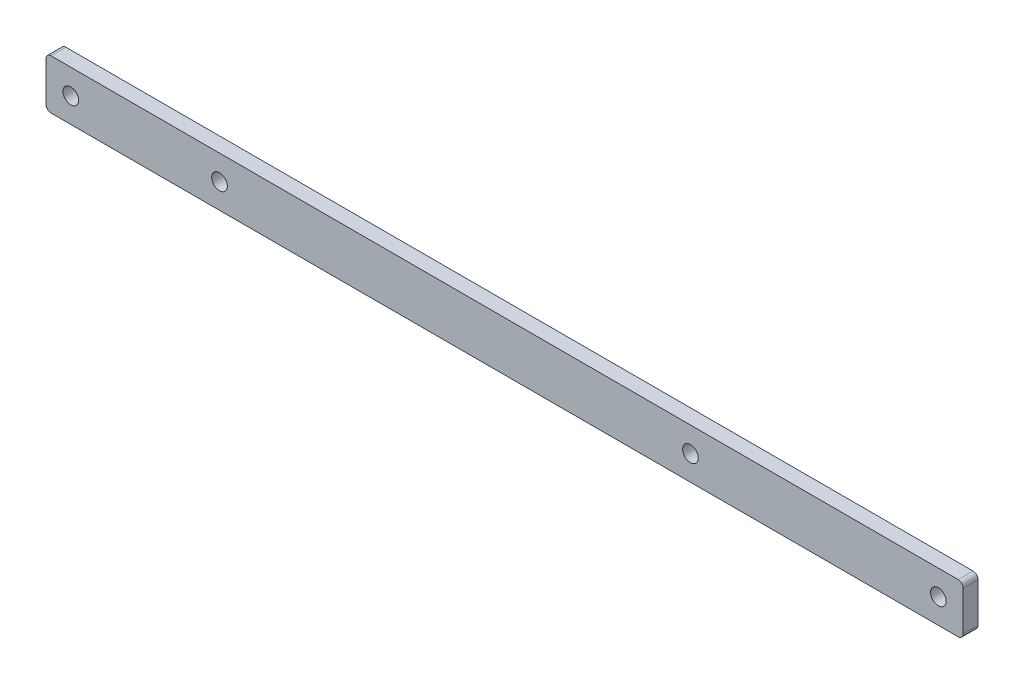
from build123d import *

# Parameters (mm, degrees)
SKETCH1_W           = 469.9
SKETCH1_H           = 25.4
BOSS_EXTRUDE1_DEPTH = 7.62
SKETCH2_R           = 4
CUT_EXTRUDE1_DEPTH  = 471.647675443
FILLET1_R           = 2.54
SKETCH3_R           = 4
CUT_EXTRUDE2_DEPTH  = 471.647675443


with BuildPart() as part:
    # Sketch1 → Boss-Extrude1 (new body)
    with BuildSketch(Plane.XY):
        with Locations((234.95, 12.7)):
            Rectangle(SKETCH1_W, SKETCH1_H)
    extrude(amount=BOSS_EXTRUDE1_DEPTH)

    # Sketch2 → Cut-Extrude1 (cut, through all)
    with BuildSketch(Plane.XY.offset(7.62)):
        with Locations((12.7, 12.7)):
            Circle(SKETCH2_R)
    cut_extrude1 = extrude(amount=-CUT_EXTRUDE1_DEPTH, mode=Mode.SUBTRACT)

    # Mirror1: Cut-Extrude1 across plane
    add(cut_extrude1.mirror(Plane(origin=(234.95, 0, 0), x_dir=(0, 0, 1), z_dir=(1, 0, 0))), mode=Mode.SUBTRACT)

    # Fillet1
    fillet1_edges = [part.edges().sort_by_distance(p)[0] for p in [
        (0, 25.4, 3.81),
        (469.9, 25.4, 3.81),
        (469.9, 0, 3.81),
        (0, 0, 3.81),
    ]]
    fillet(fillet1_edges, radius=FILLET1_R)

    # Sketch3 → Cut-Extrude2 (cut, through all)
    with BuildSketch(Plane.XY.offset(7.62)):
        with Locations((88.9, 12.7)):
            Circle(SKETCH3_R)
        with Locations((330.2, 12.7)):
            Circle(SKETCH3_R)
    extrude(amount=-CUT_EXTRUDE2_DEPTH, mode=Mode.SUBTRACT)


solid = part.part
